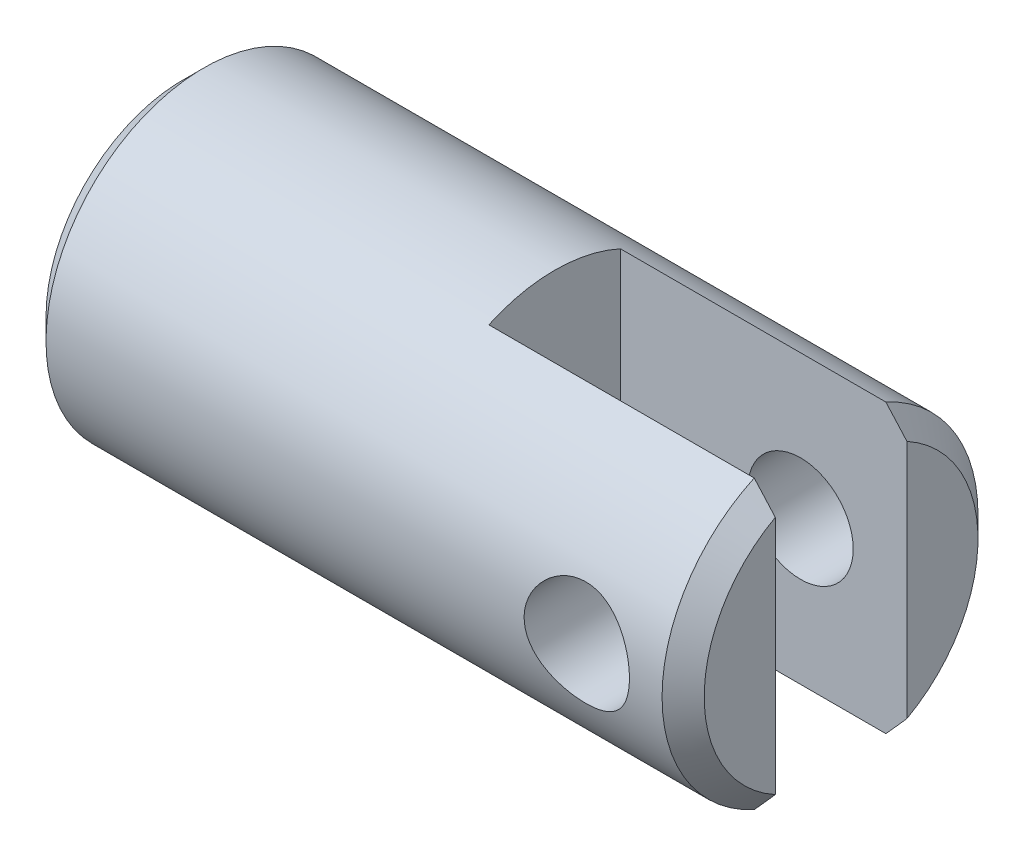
ISO-10303-21;
HEADER;
FILE_DESCRIPTION(('STEP AP214'),'2;1');
FILE_NAME('part.step','',(''),(''),'','','');
FILE_SCHEMA(('AUTOMOTIVE_DESIGN { 1 0 10303 214 1 1 1 1 }'));
ENDSEC;
DATA;
#1=APPLICATION_CONTEXT('core data for automotive mechanical design processes');
#2=APPLICATION_PROTOCOL_DEFINITION('international standard','automotive_design',2000,#1);
#3=PRODUCT_CONTEXT('',#1,'mechanical');
#4=PRODUCT('Part','Part','',(#3));
#5=PRODUCT_RELATED_PRODUCT_CATEGORY('part','',(#4));
#6=PRODUCT_DEFINITION_FORMATION('','',#4);
#7=PRODUCT_DEFINITION_CONTEXT('part definition',#1,'design');
#8=PRODUCT_DEFINITION('design','',#6,#7);
#9=PRODUCT_DEFINITION_SHAPE('','',#8);
#10=(LENGTH_UNIT() NAMED_UNIT(*) SI_UNIT(.MILLI.,.METRE.));
#11=(NAMED_UNIT(*) PLANE_ANGLE_UNIT() SI_UNIT($,.RADIAN.));
#12=(NAMED_UNIT(*) SI_UNIT($,.STERADIAN.) SOLID_ANGLE_UNIT());
#13=UNCERTAINTY_MEASURE_WITH_UNIT(LENGTH_MEASURE(1.E-05),#10,'distance_accuracy_value','');
#14=(GEOMETRIC_REPRESENTATION_CONTEXT(3) GLOBAL_UNCERTAINTY_ASSIGNED_CONTEXT((#13)) GLOBAL_UNIT_ASSIGNED_CONTEXT((#10,
#11,#12)) REPRESENTATION_CONTEXT('',''));
#15=CARTESIAN_POINT('',(0.,0.,0.));
#16=DIRECTION('',(0.,0.,1.));
#17=DIRECTION('',(1.,0.,0.));
#18=AXIS2_PLACEMENT_3D('',#15,#16,#17);
#19=CARTESIAN_POINT('',(39.6875,0.,0.));
#20=DIRECTION('',(1.,0.,0.));
#21=DIRECTION('',(0.,0.,-1.));
#22=AXIS2_PLACEMENT_3D('',#19,#20,#21);
#23=PLANE('',#22);
#24=DIRECTION('',(0.,1.,0.));
#25=VECTOR('',#24,1.);
#26=CARTESIAN_POINT('',(39.6875,-8.6587902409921,-3.96875));
#27=LINE('',#26,#25);
#28=CARTESIAN_POINT('',(39.6875,-7.238373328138,-3.96875));
#29=VERTEX_POINT('',#28);
#30=CARTESIAN_POINT('',(39.6875,7.238373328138,-3.96875));
#31=VERTEX_POINT('',#30);
#32=EDGE_CURVE('E108',#29,#31,#27,.T.);
#33=ORIENTED_EDGE('',*,*,#32,.F.);
#34=CARTESIAN_POINT('',(39.6875,0.,0.));
#35=DIRECTION('',(1.,0.,0.));
#36=DIRECTION('',(0.,0.,-1.));
#37=AXIS2_PLACEMENT_3D('',#34,#35,#36);
#38=CIRCLE('',#37,8.25499999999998);
#39=EDGE_CURVE('E174',#29,#31,#38,.T.);
#40=ORIENTED_EDGE('',*,*,#39,.T.);
#41=EDGE_LOOP('',(#33,#40));
#42=FACE_BOUND('',#41,.T.);
#43=ADVANCED_FACE('F28',(#42),#23,.T.);
#44=CARTESIAN_POINT('',(39.6875,0.,0.));
#45=DIRECTION('',(-1.,0.,0.));
#46=DIRECTION('',(0.,0.,1.));
#47=AXIS2_PLACEMENT_3D('',#44,#45,#46);
#48=CYLINDRICAL_SURFACE('',#47,9.525);
#49=CARTESIAN_POINT('',(1.27000000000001,0.,0.));
#50=DIRECTION('',(1.,0.,0.));
#51=DIRECTION('',(0.,0.,-1.));
#52=AXIS2_PLACEMENT_3D('',#49,#50,#51);
#53=CIRCLE('',#52,9.525);
#54=CARTESIAN_POINT('',(1.27000000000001,0.,-9.525));
#55=VERTEX_POINT('',#54);
#56=EDGE_CURVE('E126',#55,#55,#53,.T.);
#57=ORIENTED_EDGE('',*,*,#56,.T.);
#58=EDGE_LOOP('',(#57));
#59=FACE_BOUND('',#58,.T.);
#60=CARTESIAN_POINT('',(36.449,0.,-9.525));
#61=CARTESIAN_POINT('',(36.449000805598,0.173238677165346,-9.52500048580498));
#62=CARTESIAN_POINT('',(36.4347751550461,0.346472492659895,-9.52023018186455));
#63=CARTESIAN_POINT('',(36.3784225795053,0.687837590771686,-9.50167042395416));
#64=CARTESIAN_POINT('',(36.3362927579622,0.855968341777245,-9.48788003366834));
#65=CARTESIAN_POINT('',(36.2257364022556,1.18215660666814,-9.45277852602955));
#66=CARTESIAN_POINT('',(36.1573538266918,1.34023044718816,-9.43147998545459));
#67=CARTESIAN_POINT('',(35.9964317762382,1.6426654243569,-9.3835361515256));
#68=CARTESIAN_POINT('',(35.9038875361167,1.78702384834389,-9.35688980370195));
#69=CARTESIAN_POINT('',(35.6939030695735,2.06292981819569,-9.30002249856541));
#70=CARTESIAN_POINT('',(35.5757758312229,2.19393674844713,-9.26971591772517));
#71=CARTESIAN_POINT('',(35.3194392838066,2.43469379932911,-9.20941499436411));
#72=CARTESIAN_POINT('',(35.181225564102,2.54443923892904,-9.17942072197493));
#73=CARTESIAN_POINT('',(34.8837722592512,2.74264419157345,-9.12219830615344));
#74=CARTESIAN_POINT('',(34.7240423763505,2.83040092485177,-9.0950744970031));
#75=CARTESIAN_POINT('',(34.3910409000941,2.97757492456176,-9.04796594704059));
#76=CARTESIAN_POINT('',(34.2177734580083,3.03700083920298,-9.02797902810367));
#77=CARTESIAN_POINT('',(33.8687625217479,3.12379824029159,-8.99830887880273));
#78=CARTESIAN_POINT('',(33.6932993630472,3.15218269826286,-8.98830104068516));
#79=CARTESIAN_POINT('',(33.3398375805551,3.17925806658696,-8.97876209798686));
#80=CARTESIAN_POINT('',(33.1618397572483,3.17795815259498,-8.97922775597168));
#81=CARTESIAN_POINT('',(32.8170011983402,3.14648819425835,-8.99029872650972));
#82=CARTESIAN_POINT('',(32.6500223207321,3.1176401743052,-9.00043970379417));
#83=CARTESIAN_POINT('',(32.3234258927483,3.03404956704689,-9.02895888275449));
#84=CARTESIAN_POINT('',(32.1638092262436,2.97930387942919,-9.04733807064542));
#85=CARTESIAN_POINT('',(31.853464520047,2.84460650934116,-9.09059367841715));
#86=CARTESIAN_POINT('',(31.7029210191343,2.76426310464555,-9.11556996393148));
#87=CARTESIAN_POINT('',(31.4170348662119,2.58092291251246,-9.16916373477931));
#88=CARTESIAN_POINT('',(31.2816966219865,2.47791958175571,-9.19778227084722));
#89=CARTESIAN_POINT('',(31.0226341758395,2.2458341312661,-9.25726270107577));
#90=CARTESIAN_POINT('',(30.8998851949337,2.11567125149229,-9.28816371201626));
#91=CARTESIAN_POINT('',(30.6777032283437,1.83622813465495,-9.34742029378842));
#92=CARTESIAN_POINT('',(30.5782724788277,1.68694606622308,-9.37577562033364));
#93=CARTESIAN_POINT('',(30.4047642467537,1.3714336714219,-9.42711817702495));
#94=CARTESIAN_POINT('',(30.3309480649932,1.20504990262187,-9.45004936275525));
#95=CARTESIAN_POINT('',(30.2126549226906,0.86127933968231,-9.4875530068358));
#96=CARTESIAN_POINT('',(30.1681677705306,0.683896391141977,-9.50212836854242));
#97=CARTESIAN_POINT('',(30.111523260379,0.33141865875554,-9.52079715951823));
#98=CARTESIAN_POINT('',(30.0980481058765,0.156557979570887,-9.52531755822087));
#99=CARTESIAN_POINT('',(30.1000562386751,-0.192960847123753,-9.52464766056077));
#100=CARTESIAN_POINT('',(30.1155346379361,-0.36761902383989,-9.51945900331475));
#101=CARTESIAN_POINT('',(30.1739678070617,-0.706500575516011,-9.50023578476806));
#102=CARTESIAN_POINT('',(30.2161137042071,-0.870879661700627,-9.48646180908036));
#103=CARTESIAN_POINT('',(30.3256741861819,-1.19016766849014,-9.45171613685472));
#104=CARTESIAN_POINT('',(30.3930919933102,-1.34507537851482,-9.43074352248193));
#105=CARTESIAN_POINT('',(30.5532486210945,-1.64556534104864,-9.38304356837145));
#106=CARTESIAN_POINT('',(30.6466068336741,-1.79079512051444,-9.35617936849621));
#107=CARTESIAN_POINT('',(30.8552664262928,-2.06395583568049,-9.29974181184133));
#108=CARTESIAN_POINT('',(30.9705745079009,-2.19188146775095,-9.27016762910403));
#109=CARTESIAN_POINT('',(31.2260575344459,-2.432851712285,-9.20993992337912));
#110=CARTESIAN_POINT('',(31.3671242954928,-2.54495607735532,-9.17929841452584));
#111=CARTESIAN_POINT('',(31.6667247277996,-2.74401763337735,-9.121774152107));
#112=CARTESIAN_POINT('',(31.8252585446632,-2.83097461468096,-9.09489142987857));
#113=CARTESIAN_POINT('',(32.1553618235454,-2.97687025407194,-9.04819093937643));
#114=CARTESIAN_POINT('',(32.3269041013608,-3.03586556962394,-9.02835890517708));
#115=CARTESIAN_POINT('',(32.6783022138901,-3.12386556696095,-8.99829392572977));
#116=CARTESIAN_POINT('',(32.8581542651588,-3.15288375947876,-8.98805665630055));
#117=CARTESIAN_POINT('',(33.2111257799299,-3.17905219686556,-8.97883201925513));
#118=CARTESIAN_POINT('',(33.3841164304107,-3.17776306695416,-8.97929370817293));
#119=CARTESIAN_POINT('',(33.7272791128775,-3.1471942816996,-8.99005281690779));
#120=CARTESIAN_POINT('',(33.8974513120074,-3.11791629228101,-9.00034965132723));
#121=CARTESIAN_POINT('',(34.2269307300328,-3.03330550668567,-9.02920864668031));
#122=CARTESIAN_POINT('',(34.3863829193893,-2.97847812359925,-9.04761011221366));
#123=CARTESIAN_POINT('',(34.693947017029,-2.84473448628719,-9.09054566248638));
#124=CARTESIAN_POINT('',(34.8420563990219,-2.76581288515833,-9.11508110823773));
#125=CARTESIAN_POINT('',(35.1297356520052,-2.58210269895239,-9.16885482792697));
#126=CARTESIAN_POINT('',(35.2686508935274,-2.47633567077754,-9.19825159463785));
#127=CARTESIAN_POINT('',(35.5272651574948,-2.24359115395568,-9.25777156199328));
#128=CARTESIAN_POINT('',(35.6469587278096,-2.11660766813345,-9.28789496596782));
#129=CARTESIAN_POINT('',(35.8684335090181,-1.83909194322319,-9.34688346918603));
#130=CARTESIAN_POINT('',(35.9693348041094,-1.68783480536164,-9.3756537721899));
#131=CARTESIAN_POINT('',(36.1441696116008,-1.36955960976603,-9.42740021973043));
#132=CARTESIAN_POINT('',(36.2181100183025,-1.2025455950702,-9.45037784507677));
#133=CARTESIAN_POINT('',(36.3338161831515,-0.865167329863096,-9.48707510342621));
#134=CARTESIAN_POINT('',(36.3768718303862,-0.695286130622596,-9.50116249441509));
#135=CARTESIAN_POINT('',(36.4344593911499,-0.350267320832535,-9.52012342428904));
#136=CARTESIAN_POINT('',(36.4489991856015,-0.17513117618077,-9.52499950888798));
#137=CARTESIAN_POINT('',(36.449,0.,-9.525));
#138=B_SPLINE_CURVE_WITH_KNOTS('',3,(#60,#61,#62,#63,#64,#65,#66,#67,#68,#69,#70,#71,#72,#73,
#74,#75,#76,#77,#78,#79,#80,#81,#82,#83,#84,#85,#86,#87,#88,#89,#90,#91,#92,#93,#94,#95,#96,#97,
#98,#99,#100,#101,#102,#103,#104,#105,#106,#107,#108,#109,#110,#111,#112,#113,#114,#115,#116,
#117,#118,#119,#120,#121,#122,#123,#124,#125,#126,#127,#128,#129,#130,#131,#132,#133,#134,#135,
#136,#137),.UNSPECIFIED.,.T.,.F.,(4,2,2,2,2,2,2,2,2,2,2,2,2,2,2,2,2,2,2,2,2,2,2,2,2,2,2,2,2,2,2,
2,2,2,2,2,2,2,4),(0.,0.519071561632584,1.03819701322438,1.55645698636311,2.07481924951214,
2.6093637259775,3.14402575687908,3.69406121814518,4.24392866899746,4.77526114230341,
5.30642937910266,5.81332424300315,6.32027980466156,6.8353994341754,7.35066800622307,
7.8928374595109,8.43505888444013,8.98265937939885,9.53006948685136,10.0537512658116,
10.5773446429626,11.0857715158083,11.5942632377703,12.1161301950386,12.638156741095,
13.1839024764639,13.7296527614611,14.2742924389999,14.8186865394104,15.3351123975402,
15.8515075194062,16.3580948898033,16.8647947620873,17.3936046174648,17.92256420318,
18.4721392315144,19.0215736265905,19.5464607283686,20.0712027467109),.UNSPECIFIED.);
#139=CARTESIAN_POINT('',(36.449,0.,-9.525));
#140=VERTEX_POINT('',#139);
#141=EDGE_CURVE('E195',#140,#140,#138,.T.);
#142=ORIENTED_EDGE('',*,*,#141,.T.);
#143=EDGE_LOOP('',(#142));
#144=FACE_BOUND('',#143,.T.);
#145=CARTESIAN_POINT('',(36.449,0.,9.52499999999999));
#146=CARTESIAN_POINT('',(36.449000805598,-0.173238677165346,9.52500048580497));
#147=CARTESIAN_POINT('',(36.4347751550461,-0.346472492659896,9.52023018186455));
#148=CARTESIAN_POINT('',(36.3784225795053,-0.687837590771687,9.50167042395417));
#149=CARTESIAN_POINT('',(36.3362927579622,-0.855968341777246,9.48788003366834));
#150=CARTESIAN_POINT('',(36.2257364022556,-1.18215660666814,9.45277852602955));
#151=CARTESIAN_POINT('',(36.1573538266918,-1.34023044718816,9.43147998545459));
#152=CARTESIAN_POINT('',(35.9964317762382,-1.64266542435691,9.3835361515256));
#153=CARTESIAN_POINT('',(35.9038875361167,-1.78702384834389,9.35688980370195));
#154=CARTESIAN_POINT('',(35.6939030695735,-2.0629298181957,9.30002249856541));
#155=CARTESIAN_POINT('',(35.5757758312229,-2.19393674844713,9.26971591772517));
#156=CARTESIAN_POINT('',(35.3194392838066,-2.43469379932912,9.20941499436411));
#157=CARTESIAN_POINT('',(35.181225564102,-2.54443923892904,9.17942072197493));
#158=CARTESIAN_POINT('',(34.8837722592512,-2.74264419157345,9.12219830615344));
#159=CARTESIAN_POINT('',(34.7240423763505,-2.83040092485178,9.0950744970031));
#160=CARTESIAN_POINT('',(34.3910409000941,-2.97757492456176,9.04796594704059));
#161=CARTESIAN_POINT('',(34.2177734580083,-3.03700083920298,9.02797902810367));
#162=CARTESIAN_POINT('',(33.8687625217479,-3.12379824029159,8.99830887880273));
#163=CARTESIAN_POINT('',(33.6932993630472,-3.15218269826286,8.98830104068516));
#164=CARTESIAN_POINT('',(33.3398375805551,-3.17925806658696,8.97876209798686));
#165=CARTESIAN_POINT('',(33.1618397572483,-3.17795815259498,8.97922775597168));
#166=CARTESIAN_POINT('',(32.8170011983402,-3.14648819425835,8.99029872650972));
#167=CARTESIAN_POINT('',(32.6500223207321,-3.1176401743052,9.00043970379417));
#168=CARTESIAN_POINT('',(32.3234258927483,-3.03404956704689,9.02895888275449));
#169=CARTESIAN_POINT('',(32.1638092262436,-2.97930387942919,9.04733807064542));
#170=CARTESIAN_POINT('',(31.853464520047,-2.84460650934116,9.09059367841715));
#171=CARTESIAN_POINT('',(31.7029210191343,-2.76426310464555,9.11556996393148));
#172=CARTESIAN_POINT('',(31.4170348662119,-2.58092291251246,9.16916373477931));
#173=CARTESIAN_POINT('',(31.2816966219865,-2.47791958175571,9.19778227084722));
#174=CARTESIAN_POINT('',(31.0226341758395,-2.2458341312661,9.25726270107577));
#175=CARTESIAN_POINT('',(30.8998851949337,-2.11567125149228,9.28816371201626));
#176=CARTESIAN_POINT('',(30.6777032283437,-1.83622813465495,9.34742029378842));
#177=CARTESIAN_POINT('',(30.5782724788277,-1.68694606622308,9.37577562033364));
#178=CARTESIAN_POINT('',(30.4047642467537,-1.3714336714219,9.42711817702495));
#179=CARTESIAN_POINT('',(30.3309480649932,-1.20504990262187,9.45004936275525));
#180=CARTESIAN_POINT('',(30.2126549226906,-0.86127933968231,9.4875530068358));
#181=CARTESIAN_POINT('',(30.1681677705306,-0.683896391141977,9.50212836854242));
#182=CARTESIAN_POINT('',(30.111523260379,-0.331418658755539,9.52079715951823));
#183=CARTESIAN_POINT('',(30.0980481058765,-0.156557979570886,9.52531755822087));
#184=CARTESIAN_POINT('',(30.1000562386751,0.192960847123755,9.52464766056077));
#185=CARTESIAN_POINT('',(30.1155346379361,0.367619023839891,9.51945900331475));
#186=CARTESIAN_POINT('',(30.1739678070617,0.706500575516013,9.50023578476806));
#187=CARTESIAN_POINT('',(30.2161137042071,0.870879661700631,9.48646180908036));
#188=CARTESIAN_POINT('',(30.3256741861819,1.19016766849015,9.45171613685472));
#189=CARTESIAN_POINT('',(30.3930919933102,1.34507537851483,9.43074352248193));
#190=CARTESIAN_POINT('',(30.5532486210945,1.64556534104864,9.38304356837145));
#191=CARTESIAN_POINT('',(30.6466068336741,1.79079512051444,9.35617936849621));
#192=CARTESIAN_POINT('',(30.8552664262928,2.06395583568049,9.29974181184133));
#193=CARTESIAN_POINT('',(30.9705745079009,2.19188146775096,9.27016762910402));
#194=CARTESIAN_POINT('',(31.2260575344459,2.432851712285,9.20993992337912));
#195=CARTESIAN_POINT('',(31.3671242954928,2.54495607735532,9.17929841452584));
#196=CARTESIAN_POINT('',(31.6667247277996,2.74401763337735,9.121774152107));
#197=CARTESIAN_POINT('',(31.8252585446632,2.83097461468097,9.09489142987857));
#198=CARTESIAN_POINT('',(32.1553618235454,2.97687025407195,9.04819093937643));
#199=CARTESIAN_POINT('',(32.3269041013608,3.03586556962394,9.02835890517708));
#200=CARTESIAN_POINT('',(32.6783022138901,3.12386556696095,8.99829392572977));
#201=CARTESIAN_POINT('',(32.8581542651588,3.15288375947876,8.98805665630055));
#202=CARTESIAN_POINT('',(33.2111257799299,3.17905219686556,8.97883201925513));
#203=CARTESIAN_POINT('',(33.3841164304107,3.17776306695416,8.97929370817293));
#204=CARTESIAN_POINT('',(33.7272791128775,3.1471942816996,8.99005281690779));
#205=CARTESIAN_POINT('',(33.8974513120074,3.11791629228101,9.00034965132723));
#206=CARTESIAN_POINT('',(34.2269307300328,3.03330550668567,9.02920864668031));
#207=CARTESIAN_POINT('',(34.3863829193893,2.97847812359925,9.04761011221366));
#208=CARTESIAN_POINT('',(34.693947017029,2.84473448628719,9.09054566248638));
#209=CARTESIAN_POINT('',(34.8420563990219,2.76581288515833,9.11508110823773));
#210=CARTESIAN_POINT('',(35.1297356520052,2.58210269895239,9.16885482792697));
#211=CARTESIAN_POINT('',(35.2686508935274,2.47633567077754,9.19825159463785));
#212=CARTESIAN_POINT('',(35.5272651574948,2.24359115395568,9.25777156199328));
#213=CARTESIAN_POINT('',(35.6469587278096,2.11660766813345,9.28789496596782));
#214=CARTESIAN_POINT('',(35.8684335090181,1.83909194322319,9.34688346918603));
#215=CARTESIAN_POINT('',(35.9693348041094,1.68783480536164,9.3756537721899));
#216=CARTESIAN_POINT('',(36.1441696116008,1.36955960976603,9.42740021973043));
#217=CARTESIAN_POINT('',(36.2181100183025,1.2025455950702,9.45037784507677));
#218=CARTESIAN_POINT('',(36.3338161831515,0.865167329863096,9.48707510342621));
#219=CARTESIAN_POINT('',(36.3768718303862,0.695286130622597,9.5011624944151));
#220=CARTESIAN_POINT('',(36.4344593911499,0.350267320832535,9.52012342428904));
#221=CARTESIAN_POINT('',(36.4489991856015,0.17513117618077,9.52499950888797));
#222=CARTESIAN_POINT('',(36.449,0.,9.52499999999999));
#223=B_SPLINE_CURVE_WITH_KNOTS('',3,(#145,#146,#147,#148,#149,#150,#151,#152,#153,#154,#155,
#156,#157,#158,#159,#160,#161,#162,#163,#164,#165,#166,#167,#168,#169,#170,#171,#172,#173,#174,
#175,#176,#177,#178,#179,#180,#181,#182,#183,#184,#185,#186,#187,#188,#189,#190,#191,#192,#193,
#194,#195,#196,#197,#198,#199,#200,#201,#202,#203,#204,#205,#206,#207,#208,#209,#210,#211,#212,
#213,#214,#215,#216,#217,#218,#219,#220,#221,#222),.UNSPECIFIED.,.T.,.F.,(4,2,2,2,2,2,2,2,2,2,2,
2,2,2,2,2,2,2,2,2,2,2,2,2,2,2,2,2,2,2,2,2,2,2,2,2,2,2,4),(0.,0.519071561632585,1.03819701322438,
1.55645698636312,2.07481924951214,2.6093637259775,3.14402575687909,3.69406121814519,
4.24392866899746,4.77526114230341,5.30642937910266,5.81332424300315,6.32027980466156,
6.8353994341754,7.35066800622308,7.8928374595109,8.43505888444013,8.98265937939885,
9.53006948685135,10.0537512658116,10.5773446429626,11.0857715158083,11.5942632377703,
12.1161301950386,12.638156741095,13.1839024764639,13.7296527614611,14.2742924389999,
14.8186865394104,15.3351123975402,15.8515075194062,16.3580948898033,16.8647947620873,
17.3936046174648,17.92256420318,18.4721392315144,19.0215736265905,19.5464607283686,
20.0712027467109),.UNSPECIFIED.);
#224=CARTESIAN_POINT('',(36.449,0.,9.52499999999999));
#225=VERTEX_POINT('',#224);
#226=EDGE_CURVE('E198',#225,#225,#223,.T.);
#227=ORIENTED_EDGE('',*,*,#226,.T.);
#228=EDGE_LOOP('',(#227));
#229=FACE_BOUND('',#228,.T.);
#230=DIRECTION('',(1.,0.,0.));
#231=VECTOR('',#230,1.);
#232=CARTESIAN_POINT('',(22.4155,-8.6587902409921,3.96875));
#233=LINE('',#232,#231);
#234=CARTESIAN_POINT('',(22.4155,-8.6587902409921,3.96875));
#235=VERTEX_POINT('',#234);
#236=CARTESIAN_POINT('',(38.4175,-8.6587902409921,3.96875));
#237=VERTEX_POINT('',#236);
#238=EDGE_CURVE('E95',#235,#237,#233,.T.);
#239=ORIENTED_EDGE('',*,*,#238,.T.);
#240=CARTESIAN_POINT('',(38.4175,0.,0.));
#241=DIRECTION('',(1.,0.,0.));
#242=DIRECTION('',(0.,0.,-1.));
#243=AXIS2_PLACEMENT_3D('',#240,#241,#242);
#244=CIRCLE('',#243,9.525);
#245=CARTESIAN_POINT('',(38.4175,8.6587902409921,3.96875));
#246=VERTEX_POINT('',#245);
#247=EDGE_CURVE('E111',#237,#246,#244,.F.);
#248=ORIENTED_EDGE('',*,*,#247,.T.);
#249=DIRECTION('',(1.,0.,0.));
#250=VECTOR('',#249,1.);
#251=CARTESIAN_POINT('',(22.4155,8.6587902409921,3.96875));
#252=LINE('',#251,#250);
#253=CARTESIAN_POINT('',(22.4155,8.6587902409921,3.96875));
#254=VERTEX_POINT('',#253);
#255=EDGE_CURVE('E92',#254,#246,#252,.T.);
#256=ORIENTED_EDGE('',*,*,#255,.F.);
#257=CARTESIAN_POINT('',(22.4155,0.,0.));
#258=DIRECTION('',(1.,0.,0.));
#259=DIRECTION('',(0.,0.,-1.));
#260=AXIS2_PLACEMENT_3D('',#257,#258,#259);
#261=CIRCLE('',#260,9.525);
#262=CARTESIAN_POINT('',(22.4155,8.6587902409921,-3.96875));
#263=VERTEX_POINT('',#262);
#264=EDGE_CURVE('E99',#263,#254,#261,.T.);
#265=ORIENTED_EDGE('',*,*,#264,.F.);
#266=DIRECTION('',(1.,0.,0.));
#267=VECTOR('',#266,1.);
#268=CARTESIAN_POINT('',(22.4155,8.6587902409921,-3.96875));
#269=LINE('',#268,#267);
#270=CARTESIAN_POINT('',(38.4175,8.6587902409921,-3.96875));
#271=VERTEX_POINT('',#270);
#272=EDGE_CURVE('E124',#263,#271,#269,.T.);
#273=ORIENTED_EDGE('',*,*,#272,.T.);
#274=CARTESIAN_POINT('',(38.4175,0.,0.));
#275=DIRECTION('',(1.,0.,0.));
#276=DIRECTION('',(0.,0.,-1.));
#277=AXIS2_PLACEMENT_3D('',#274,#275,#276);
#278=CIRCLE('',#277,9.525);
#279=CARTESIAN_POINT('',(38.4175,-8.6587902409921,-3.96875));
#280=VERTEX_POINT('',#279);
#281=EDGE_CURVE('E122',#271,#280,#278,.F.);
#282=ORIENTED_EDGE('',*,*,#281,.T.);
#283=DIRECTION('',(1.,0.,0.));
#284=VECTOR('',#283,1.);
#285=CARTESIAN_POINT('',(22.4155,-8.6587902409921,-3.96875));
#286=LINE('',#285,#284);
#287=CARTESIAN_POINT('',(22.4155,-8.6587902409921,-3.96875));
#288=VERTEX_POINT('',#287);
#289=EDGE_CURVE('E113',#288,#280,#286,.T.);
#290=ORIENTED_EDGE('',*,*,#289,.F.);
#291=CARTESIAN_POINT('',(22.4155,0.,0.));
#292=DIRECTION('',(1.,0.,0.));
#293=DIRECTION('',(0.,0.,-1.));
#294=AXIS2_PLACEMENT_3D('',#291,#292,#293);
#295=CIRCLE('',#294,9.525);
#296=EDGE_CURVE('E98',#235,#288,#295,.T.);
#297=ORIENTED_EDGE('',*,*,#296,.F.);
#298=EDGE_LOOP('',(#239,#248,#256,#265,#273,#282,#290,#297));
#299=FACE_BOUND('',#298,.T.);
#300=ADVANCED_FACE('F30',(#59,#144,#229,#299),#48,.T.);
#301=DIRECTION('',(0.,-1.,0.));
#302=VECTOR('',#301,1.);
#303=CARTESIAN_POINT('',(39.6875,8.6587902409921,3.96875));
#304=LINE('',#303,#302);
#305=CARTESIAN_POINT('',(39.6875,7.238373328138,3.96875));
#306=VERTEX_POINT('',#305);
#307=CARTESIAN_POINT('',(39.6875,-7.238373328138,3.96875));
#308=VERTEX_POINT('',#307);
#309=EDGE_CURVE('E175',#306,#308,#304,.T.);
#310=ORIENTED_EDGE('',*,*,#309,.F.);
#311=CARTESIAN_POINT('',(39.6875,0.,0.));
#312=DIRECTION('',(1.,0.,0.));
#313=DIRECTION('',(0.,0.,-1.));
#314=AXIS2_PLACEMENT_3D('',#311,#312,#313);
#315=CIRCLE('',#314,8.25499999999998);
#316=EDGE_CURVE('E132',#306,#308,#315,.T.);
#317=ORIENTED_EDGE('',*,*,#316,.T.);
#318=EDGE_LOOP('',(#310,#317));
#319=FACE_BOUND('',#318,.T.);
#320=ADVANCED_FACE('F160',(#319),#23,.T.);
#321=CARTESIAN_POINT('',(0.,0.,0.));
#322=DIRECTION('',(1.,0.,0.));
#323=DIRECTION('',(0.,0.,-1.));
#324=AXIS2_PLACEMENT_3D('',#321,#322,#323);
#325=PLANE('',#324);
#326=CARTESIAN_POINT('',(0.,0.,0.));
#327=DIRECTION('',(1.,0.,0.));
#328=DIRECTION('',(0.,0.,-1.));
#329=AXIS2_PLACEMENT_3D('',#326,#327,#328);
#330=CIRCLE('',#329,8.25499999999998);
#331=CARTESIAN_POINT('',(0.,0.,-8.25499999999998));
#332=VERTEX_POINT('',#331);
#333=EDGE_CURVE('E129',#332,#332,#330,.F.);
#334=ORIENTED_EDGE('',*,*,#333,.T.);
#335=EDGE_LOOP('',(#334));
#336=FACE_BOUND('',#335,.T.);
#337=ADVANCED_FACE('F157',(#336),#325,.F.);
#338=CARTESIAN_POINT('',(22.4155,-8.6587902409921,-3.96875));
#339=DIRECTION('',(0.,0.,-1.));
#340=DIRECTION('',(-1.,0.,0.));
#341=AXIS2_PLACEMENT_3D('',#338,#339,#340);
#342=PLANE('',#341);
#343=CARTESIAN_POINT('',(33.274,0.,-3.96875));
#344=DIRECTION('',(0.,0.,-1.));
#345=DIRECTION('',(-1.,0.,0.));
#346=AXIS2_PLACEMENT_3D('',#343,#344,#345);
#347=CIRCLE('',#346,3.175);
#348=CARTESIAN_POINT('',(30.099,0.,-3.96875));
#349=VERTEX_POINT('',#348);
#350=EDGE_CURVE('E121',#349,#349,#347,.T.);
#351=ORIENTED_EDGE('',*,*,#350,.T.);
#352=EDGE_LOOP('',(#351));
#353=FACE_BOUND('',#352,.T.);
#354=ORIENTED_EDGE('',*,*,#32,.T.);
#355=CARTESIAN_POINT('',(39.6875,7.238373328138,-3.96875));
#356=CARTESIAN_POINT('',(39.582811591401,7.35776096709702,-3.96875));
#357=CARTESIAN_POINT('',(39.4777893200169,7.47685515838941,-3.96875));
#358=CARTESIAN_POINT('',(39.2671521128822,7.71451414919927,-3.96875));
#359=CARTESIAN_POINT('',(39.1615371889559,7.83307895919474,-3.96875));
#360=CARTESIAN_POINT('',(38.9497859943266,8.06974095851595,-3.96875));
#361=CARTESIAN_POINT('',(38.8436497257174,8.18783814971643,-3.96875));
#362=CARTESIAN_POINT('',(38.6309102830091,8.42361556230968,-3.96875));
#363=CARTESIAN_POINT('',(38.5243070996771,8.54129577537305,-3.96875));
#364=CARTESIAN_POINT('',(38.4175,8.6587902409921,-3.96875));
#365=B_SPLINE_CURVE_WITH_KNOTS('',3,(#355,#356,#357,#358,#359,#360,#361,#362,#363,#364),
.UNSPECIFIED.,.F.,.F.,(4,2,2,2,4),(0.,0.476357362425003,0.952705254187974,1.42905123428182,
1.90540667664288),.UNSPECIFIED.);
#366=EDGE_CURVE('E11',#31,#271,#365,.T.);
#367=ORIENTED_EDGE('',*,*,#366,.T.);
#368=ORIENTED_EDGE('',*,*,#272,.F.);
#369=DIRECTION('',(0.,1.,0.));
#370=VECTOR('',#369,1.);
#371=CARTESIAN_POINT('',(22.4155,-8.6587902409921,-3.96875));
#372=LINE('',#371,#370);
#373=EDGE_CURVE('E105',#288,#263,#372,.T.);
#374=ORIENTED_EDGE('',*,*,#373,.F.);
#375=ORIENTED_EDGE('',*,*,#289,.T.);
#376=CARTESIAN_POINT('',(38.4175,-8.6587902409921,-3.96875));
#377=CARTESIAN_POINT('',(38.5243070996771,-8.54129577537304,-3.96875));
#378=CARTESIAN_POINT('',(38.6309102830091,-8.42361556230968,-3.96875));
#379=CARTESIAN_POINT('',(38.8436497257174,-8.18783814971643,-3.96875));
#380=CARTESIAN_POINT('',(38.9497859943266,-8.06974095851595,-3.96875));
#381=CARTESIAN_POINT('',(39.1615371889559,-7.83307895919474,-3.96875));
#382=CARTESIAN_POINT('',(39.2671521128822,-7.71451414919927,-3.96875));
#383=CARTESIAN_POINT('',(39.4777893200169,-7.47685515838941,-3.96875));
#384=CARTESIAN_POINT('',(39.582811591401,-7.35776096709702,-3.96875));
#385=CARTESIAN_POINT('',(39.6875,-7.23837332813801,-3.96875));
#386=B_SPLINE_CURVE_WITH_KNOTS('',3,(#376,#377,#378,#379,#380,#381,#382,#383,#384,#385),
.UNSPECIFIED.,.F.,.F.,(4,2,2,2,4),(0.,0.476355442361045,0.952701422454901,1.42904931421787,
1.90540667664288),.UNSPECIFIED.);
#387=EDGE_CURVE('E42',#280,#29,#386,.T.);
#388=ORIENTED_EDGE('',*,*,#387,.T.);
#389=EDGE_LOOP('',(#354,#367,#368,#374,#375,#388));
#390=FACE_BOUND('',#389,.T.);
#391=ADVANCED_FACE('F153',(#353,#390),#342,.F.);
#392=CARTESIAN_POINT('',(22.4155,8.6587902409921,3.96875));
#393=DIRECTION('',(0.,0.,1.));
#394=DIRECTION('',(1.,0.,0.));
#395=AXIS2_PLACEMENT_3D('',#392,#393,#394);
#396=PLANE('',#395);
#397=CARTESIAN_POINT('',(33.274,0.,3.96875));
#398=DIRECTION('',(0.,0.,1.));
#399=DIRECTION('',(1.,0.,0.));
#400=AXIS2_PLACEMENT_3D('',#397,#398,#399);
#401=CIRCLE('',#400,3.175);
#402=CARTESIAN_POINT('',(36.449,0.,3.96875));
#403=VERTEX_POINT('',#402);
#404=EDGE_CURVE('E118',#403,#403,#401,.T.);
#405=ORIENTED_EDGE('',*,*,#404,.T.);
#406=EDGE_LOOP('',(#405));
#407=FACE_BOUND('',#406,.T.);
#408=ORIENTED_EDGE('',*,*,#309,.T.);
#409=CARTESIAN_POINT('',(39.6875,-7.238373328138,3.96875));
#410=CARTESIAN_POINT('',(39.582811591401,-7.35776096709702,3.96875));
#411=CARTESIAN_POINT('',(39.4777893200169,-7.47685515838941,3.96875));
#412=CARTESIAN_POINT('',(39.2671521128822,-7.71451414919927,3.96875));
#413=CARTESIAN_POINT('',(39.1615371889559,-7.83307895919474,3.96875));
#414=CARTESIAN_POINT('',(38.9497859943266,-8.06974095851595,3.96875));
#415=CARTESIAN_POINT('',(38.8436497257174,-8.18783814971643,3.96875));
#416=CARTESIAN_POINT('',(38.6309102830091,-8.42361556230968,3.96875));
#417=CARTESIAN_POINT('',(38.5243070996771,-8.54129577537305,3.96875));
#418=CARTESIAN_POINT('',(38.4175,-8.6587902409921,3.96875));
#419=B_SPLINE_CURVE_WITH_KNOTS('',3,(#409,#410,#411,#412,#413,#414,#415,#416,#417,#418),
.UNSPECIFIED.,.F.,.F.,(4,2,2,2,4),(0.,0.476357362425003,0.952705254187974,1.42905123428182,
1.90540667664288),.UNSPECIFIED.);
#420=EDGE_CURVE('E142',#308,#237,#419,.T.);
#421=ORIENTED_EDGE('',*,*,#420,.T.);
#422=ORIENTED_EDGE('',*,*,#238,.F.);
#423=DIRECTION('',(0.,-1.,0.));
#424=VECTOR('',#423,1.);
#425=CARTESIAN_POINT('',(22.4155,8.6587902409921,3.96875));
#426=LINE('',#425,#424);
#427=EDGE_CURVE('E87',#254,#235,#426,.T.);
#428=ORIENTED_EDGE('',*,*,#427,.F.);
#429=ORIENTED_EDGE('',*,*,#255,.T.);
#430=CARTESIAN_POINT('',(38.4175,8.6587902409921,3.96875));
#431=CARTESIAN_POINT('',(38.5243070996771,8.54129577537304,3.96875));
#432=CARTESIAN_POINT('',(38.6309102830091,8.42361556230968,3.96875));
#433=CARTESIAN_POINT('',(38.8436497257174,8.18783814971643,3.96875));
#434=CARTESIAN_POINT('',(38.9497859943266,8.06974095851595,3.96875));
#435=CARTESIAN_POINT('',(39.1615371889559,7.83307895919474,3.96875));
#436=CARTESIAN_POINT('',(39.2671521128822,7.71451414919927,3.96875));
#437=CARTESIAN_POINT('',(39.4777893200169,7.47685515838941,3.96875));
#438=CARTESIAN_POINT('',(39.582811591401,7.35776096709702,3.96875));
#439=CARTESIAN_POINT('',(39.6875,7.23837332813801,3.96875));
#440=B_SPLINE_CURVE_WITH_KNOTS('',3,(#430,#431,#432,#433,#434,#435,#436,#437,#438,#439),
.UNSPECIFIED.,.F.,.F.,(4,2,2,2,4),(0.,0.476355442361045,0.952701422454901,1.42904931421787,
1.90540667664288),.UNSPECIFIED.);
#441=EDGE_CURVE('E135',#246,#306,#440,.T.);
#442=ORIENTED_EDGE('',*,*,#441,.T.);
#443=EDGE_LOOP('',(#408,#421,#422,#428,#429,#442));
#444=FACE_BOUND('',#443,.T.);
#445=ADVANCED_FACE('F90',(#407,#444),#396,.F.);
#446=CARTESIAN_POINT('',(22.4155,0.,0.));
#447=DIRECTION('',(1.,0.,0.));
#448=DIRECTION('',(0.,0.,-1.));
#449=AXIS2_PLACEMENT_3D('',#446,#447,#448);
#450=PLANE('',#449);
#451=ORIENTED_EDGE('',*,*,#264,.T.);
#452=ORIENTED_EDGE('',*,*,#427,.T.);
#453=ORIENTED_EDGE('',*,*,#296,.T.);
#454=ORIENTED_EDGE('',*,*,#373,.T.);
#455=EDGE_LOOP('',(#451,#452,#453,#454));
#456=FACE_BOUND('',#455,.T.);
#457=ADVANCED_FACE('F103',(#456),#450,.T.);
#458=CARTESIAN_POINT('',(33.274,0.,-9.525));
#459=DIRECTION('',(0.,0.,1.));
#460=DIRECTION('',(1.,0.,0.));
#461=AXIS2_PLACEMENT_3D('',#458,#459,#460);
#462=CYLINDRICAL_SURFACE('',#461,3.175);
#463=ORIENTED_EDGE('',*,*,#404,.F.);
#464=EDGE_LOOP('',(#463));
#465=FACE_BOUND('',#464,.T.);
#466=ORIENTED_EDGE('',*,*,#226,.F.);
#467=EDGE_LOOP('',(#466));
#468=FACE_BOUND('',#467,.T.);
#469=ADVANCED_FACE('F219',(#465,#468),#462,.F.);
#470=ORIENTED_EDGE('',*,*,#350,.F.);
#471=EDGE_LOOP('',(#470));
#472=FACE_BOUND('',#471,.T.);
#473=ORIENTED_EDGE('',*,*,#141,.F.);
#474=EDGE_LOOP('',(#473));
#475=FACE_BOUND('',#474,.T.);
#476=ADVANCED_FACE('F192',(#472,#475),#462,.F.);
#477=CARTESIAN_POINT('',(1.27000000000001,0.,0.));
#478=DIRECTION('',(1.,0.,0.));
#479=DIRECTION('',(0.,0.,-1.));
#480=AXIS2_PLACEMENT_3D('',#477,#478,#479);
#481=CONICAL_SURFACE('',#480,9.525,0.785398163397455);
#482=ORIENTED_EDGE('',*,*,#333,.F.);
#483=EDGE_LOOP('',(#482));
#484=FACE_BOUND('',#483,.T.);
#485=ORIENTED_EDGE('',*,*,#56,.F.);
#486=EDGE_LOOP('',(#485));
#487=FACE_BOUND('',#486,.T.);
#488=ADVANCED_FACE('F187',(#484,#487),#481,.T.);
#489=CARTESIAN_POINT('',(39.6875,0.,0.));
#490=DIRECTION('',(-1.,0.,0.));
#491=DIRECTION('',(0.,0.,1.));
#492=AXIS2_PLACEMENT_3D('',#489,#490,#491);
#493=CONICAL_SURFACE('',#492,8.25499999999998,0.785398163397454);
#494=ORIENTED_EDGE('',*,*,#441,.F.);
#495=ORIENTED_EDGE('',*,*,#247,.F.);
#496=ORIENTED_EDGE('',*,*,#420,.F.);
#497=ORIENTED_EDGE('',*,*,#316,.F.);
#498=EDGE_LOOP('',(#494,#495,#496,#497));
#499=FACE_BOUND('',#498,.T.);
#500=ADVANCED_FACE('F147',(#499),#493,.T.);
#501=CARTESIAN_POINT('',(39.6875,0.,0.));
#502=DIRECTION('',(-1.,0.,0.));
#503=DIRECTION('',(0.,0.,1.));
#504=AXIS2_PLACEMENT_3D('',#501,#502,#503);
#505=CONICAL_SURFACE('',#504,8.25499999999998,0.785398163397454);
#506=ORIENTED_EDGE('',*,*,#387,.F.);
#507=ORIENTED_EDGE('',*,*,#281,.F.);
#508=ORIENTED_EDGE('',*,*,#366,.F.);
#509=ORIENTED_EDGE('',*,*,#39,.F.);
#510=EDGE_LOOP('',(#506,#507,#508,#509));
#511=FACE_BOUND('',#510,.T.);
#512=ADVANCED_FACE('F177',(#511),#505,.T.);
#513=CLOSED_SHELL('',(#43,#300,#320,#337,#391,#445,#457,#469,#476,#488,#500,#512));
#514=MANIFOLD_SOLID_BREP('B2',#513);
#515=ADVANCED_BREP_SHAPE_REPRESENTATION('',(#18,#514),#14);
#516=SHAPE_DEFINITION_REPRESENTATION(#9,#515);
ENDSEC;
END-ISO-10303-21;
